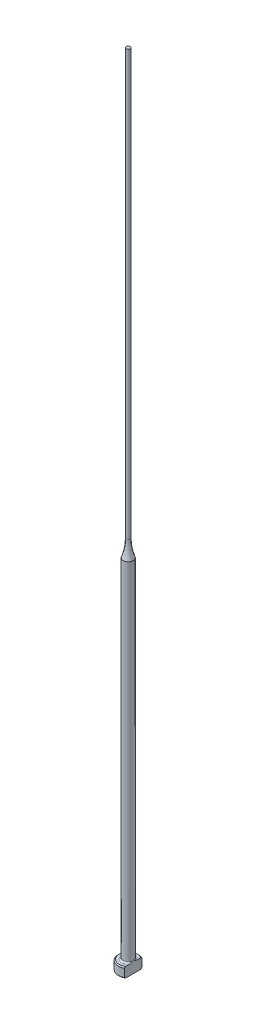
ISO-10303-21;
HEADER;
FILE_DESCRIPTION(('STEP AP214'),'2;1');
FILE_NAME('part.step','',(''),(''),'','','');
FILE_SCHEMA(('AUTOMOTIVE_DESIGN { 1 0 10303 214 1 1 1 1 }'));
ENDSEC;
DATA;
#1=APPLICATION_CONTEXT('core data for automotive mechanical design processes');
#2=APPLICATION_PROTOCOL_DEFINITION('international standard','automotive_design',2000,#1);
#3=PRODUCT_CONTEXT('',#1,'mechanical');
#4=PRODUCT('Part','Part','',(#3));
#5=PRODUCT_RELATED_PRODUCT_CATEGORY('part','',(#4));
#6=PRODUCT_DEFINITION_FORMATION('','',#4);
#7=PRODUCT_DEFINITION_CONTEXT('part definition',#1,'design');
#8=PRODUCT_DEFINITION('design','',#6,#7);
#9=PRODUCT_DEFINITION_SHAPE('','',#8);
#10=(LENGTH_UNIT() NAMED_UNIT(*) SI_UNIT(.MILLI.,.METRE.));
#11=(NAMED_UNIT(*) PLANE_ANGLE_UNIT() SI_UNIT($,.RADIAN.));
#12=(NAMED_UNIT(*) SI_UNIT($,.STERADIAN.) SOLID_ANGLE_UNIT());
#13=UNCERTAINTY_MEASURE_WITH_UNIT(LENGTH_MEASURE(1.E-05),#10,'distance_accuracy_value','');
#14=(GEOMETRIC_REPRESENTATION_CONTEXT(3) GLOBAL_UNCERTAINTY_ASSIGNED_CONTEXT((#13)) GLOBAL_UNIT_ASSIGNED_CONTEXT((#10,
#11,#12)) REPRESENTATION_CONTEXT('',''));
#15=CARTESIAN_POINT('',(0.,0.,0.));
#16=DIRECTION('',(0.,0.,1.));
#17=DIRECTION('',(1.,0.,0.));
#18=AXIS2_PLACEMENT_3D('',#15,#16,#17);
#19=CARTESIAN_POINT('',(-1.99999999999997,2.,0.));
#20=DIRECTION('',(0.,1.,0.));
#21=DIRECTION('',(0.,0.,1.));
#22=AXIS2_PLACEMENT_3D('',#19,#20,#21);
#23=PLANE('',#22);
#24=CARTESIAN_POINT('',(0.,2.,0.));
#25=DIRECTION('',(0.,1.,0.));
#26=DIRECTION('',(0.,0.,1.));
#27=AXIS2_PLACEMENT_3D('',#24,#25,#26);
#28=CIRCLE('',#27,1.79999999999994);
#29=CARTESIAN_POINT('',(0.999999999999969,2.,-1.49666295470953));
#30=VERTEX_POINT('',#29);
#31=CARTESIAN_POINT('',(0.999999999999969,2.,1.49666295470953));
#32=VERTEX_POINT('',#31);
#33=EDGE_CURVE('E187',#30,#32,#28,.T.);
#34=ORIENTED_EDGE('',*,*,#33,.T.);
#35=DIRECTION('',(0.,0.,-1.));
#36=VECTOR('',#35,1.);
#37=CARTESIAN_POINT('',(0.999999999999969,2.,0.));
#38=LINE('',#37,#36);
#39=CARTESIAN_POINT('',(0.999999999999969,2.00000000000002,0.830662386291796));
#40=VERTEX_POINT('',#39);
#41=EDGE_CURVE('E57',#32,#40,#38,.T.);
#42=ORIENTED_EDGE('',*,*,#41,.T.);
#43=CARTESIAN_POINT('',(0.,2.,0.));
#44=DIRECTION('',(0.,1.,0.));
#45=DIRECTION('',(0.,0.,1.));
#46=AXIS2_PLACEMENT_3D('',#43,#44,#45);
#47=CIRCLE('',#46,1.29999999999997);
#48=CARTESIAN_POINT('',(0.999999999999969,2.00000000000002,-0.830662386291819));
#49=VERTEX_POINT('',#48);
#50=EDGE_CURVE('E108',#40,#49,#47,.F.);
#51=ORIENTED_EDGE('',*,*,#50,.T.);
#52=EDGE_CURVE('E137',#49,#30,#38,.T.);
#53=ORIENTED_EDGE('',*,*,#52,.T.);
#54=EDGE_LOOP('',(#34,#42,#51,#53));
#55=FACE_BOUND('',#54,.T.);
#56=ADVANCED_FACE('F32',(#55),#23,.T.);
#57=CARTESIAN_POINT('',(0.,259.958771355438,0.));
#58=DIRECTION('',(0.,1.,0.));
#59=DIRECTION('',(0.,0.,1.));
#60=AXIS2_PLACEMENT_3D('',#57,#58,#59);
#61=CYLINDRICAL_SURFACE('',#60,1.99999999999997);
#62=CARTESIAN_POINT('',(0.,1.79999999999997,0.));
#63=DIRECTION('',(0.,1.,0.));
#64=DIRECTION('',(0.,0.,1.));
#65=AXIS2_PLACEMENT_3D('',#62,#63,#64);
#66=CIRCLE('',#65,1.99999999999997);
#67=CARTESIAN_POINT('',(0.999999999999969,1.79999999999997,1.73205080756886));
#68=VERTEX_POINT('',#67);
#69=CARTESIAN_POINT('',(0.999999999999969,1.79999999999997,-1.73205080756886));
#70=VERTEX_POINT('',#69);
#71=EDGE_CURVE('E105',#68,#70,#66,.F.);
#72=ORIENTED_EDGE('',*,*,#71,.T.);
#73=DIRECTION('',(0.,-1.,0.));
#74=VECTOR('',#73,1.);
#75=CARTESIAN_POINT('',(0.999999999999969,160.,-1.73205080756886));
#76=LINE('',#75,#74);
#77=CARTESIAN_POINT('',(0.999999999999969,0.199999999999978,-1.73205080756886));
#78=VERTEX_POINT('',#77);
#79=EDGE_CURVE('E193',#70,#78,#76,.T.);
#80=ORIENTED_EDGE('',*,*,#79,.T.);
#81=CARTESIAN_POINT('',(0.,0.199999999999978,0.));
#82=DIRECTION('',(0.,-1.,0.));
#83=DIRECTION('',(0.,0.,-1.));
#84=AXIS2_PLACEMENT_3D('',#81,#82,#83);
#85=CIRCLE('',#84,1.99999999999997);
#86=CARTESIAN_POINT('',(0.999999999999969,0.199999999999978,1.73205080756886));
#87=VERTEX_POINT('',#86);
#88=EDGE_CURVE('E100',#78,#87,#85,.F.);
#89=ORIENTED_EDGE('',*,*,#88,.T.);
#90=DIRECTION('',(0.,-1.,0.));
#91=VECTOR('',#90,1.);
#92=CARTESIAN_POINT('',(0.999999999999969,160.,1.73205080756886));
#93=LINE('',#92,#91);
#94=EDGE_CURVE('E93',#68,#87,#93,.T.);
#95=ORIENTED_EDGE('',*,*,#94,.F.);
#96=EDGE_LOOP('',(#72,#80,#89,#95));
#97=FACE_BOUND('',#96,.T.);
#98=ADVANCED_FACE('F158',(#97),#61,.T.);
#99=CARTESIAN_POINT('',(0.,0.,0.));
#100=DIRECTION('',(0.,-1.,0.));
#101=DIRECTION('',(0.,0.,-1.));
#102=AXIS2_PLACEMENT_3D('',#99,#100,#101);
#103=PLANE('',#102);
#104=CARTESIAN_POINT('',(0.,0.,0.));
#105=DIRECTION('',(0.,-1.,0.));
#106=DIRECTION('',(0.,0.,-1.));
#107=AXIS2_PLACEMENT_3D('',#104,#105,#106);
#108=CIRCLE('',#107,1.79999999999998);
#109=CARTESIAN_POINT('',(0.999999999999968,0.,1.49666295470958));
#110=VERTEX_POINT('',#109);
#111=CARTESIAN_POINT('',(0.999999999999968,0.,-1.49666295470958));
#112=VERTEX_POINT('',#111);
#113=EDGE_CURVE('E98',#110,#112,#108,.T.);
#114=ORIENTED_EDGE('',*,*,#113,.T.);
#115=DIRECTION('',(0.,0.,1.));
#116=VECTOR('',#115,1.);
#117=CARTESIAN_POINT('',(0.999999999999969,0.,-1.73205080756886));
#118=LINE('',#117,#116);
#119=EDGE_CURVE('E83',#112,#110,#118,.T.);
#120=ORIENTED_EDGE('',*,*,#119,.T.);
#121=EDGE_LOOP('',(#114,#120));
#122=FACE_BOUND('',#121,.T.);
#123=ADVANCED_FACE('F103',(#122),#103,.T.);
#124=CARTESIAN_POINT('',(0.,2.,0.));
#125=DIRECTION('',(0.,-1.,0.));
#126=DIRECTION('',(0.,0.,-1.));
#127=AXIS2_PLACEMENT_3D('',#124,#125,#126);
#128=CONICAL_SURFACE('',#127,1.79999999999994,0.785398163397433);
#129=ORIENTED_EDGE('',*,*,#71,.F.);
#130=CARTESIAN_POINT('',(0.999999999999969,-0.143084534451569,3.81417299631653));
#131=CARTESIAN_POINT('',(0.999999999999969,-0.0593997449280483,3.72765647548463));
#132=CARTESIAN_POINT('',(0.999999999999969,0.0241940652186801,3.64105173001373));
#133=CARTESIAN_POINT('',(0.999999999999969,0.191148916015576,3.46761616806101));
#134=CARTESIAN_POINT('',(0.999999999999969,0.274509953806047,3.3807853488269));
#135=CARTESIAN_POINT('',(0.999999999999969,0.524249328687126,3.11979400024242));
#136=CARTESIAN_POINT('',(0.999999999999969,0.690198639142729,2.94522254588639));
#137=CARTESIAN_POINT('',(0.999999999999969,1.01697550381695,2.59782670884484));
#138=CARTESIAN_POINT('',(0.999999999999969,1.17783928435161,2.42503661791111));
#139=CARTESIAN_POINT('',(0.999999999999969,1.41669118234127,2.16364984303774));
#140=CARTESIAN_POINT('',(0.999999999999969,1.49589273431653,2.07616357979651));
#141=CARTESIAN_POINT('',(0.999999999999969,1.65313803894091,1.90015721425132));
#142=CARTESIAN_POINT('',(0.999999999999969,1.73118183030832,1.81163714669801));
#143=CARTESIAN_POINT('',(0.999999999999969,1.85567318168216,1.66767927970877));
#144=CARTESIAN_POINT('',(0.999999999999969,1.90265415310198,1.61270332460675));
#145=CARTESIAN_POINT('',(0.999999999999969,1.99577882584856,1.50203557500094));
#146=CARTESIAN_POINT('',(0.999999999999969,2.04192244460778,1.44634371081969));
#147=CARTESIAN_POINT('',(0.999999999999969,2.13356596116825,1.33345480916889));
#148=CARTESIAN_POINT('',(0.999999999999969,2.17905399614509,1.2762481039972));
#149=CARTESIAN_POINT('',(0.999999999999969,2.26844283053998,1.16060976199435));
#150=CARTESIAN_POINT('',(0.999999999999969,2.3123437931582,1.10217825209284));
#151=CARTESIAN_POINT('',(0.999999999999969,2.39853453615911,0.982773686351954));
#152=CARTESIAN_POINT('',(0.999999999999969,2.44078986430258,0.921775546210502));
#153=CARTESIAN_POINT('',(0.999999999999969,2.52187810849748,0.797387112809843));
#154=CARTESIAN_POINT('',(0.999999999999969,2.56070631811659,0.733993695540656));
#155=CARTESIAN_POINT('',(0.999999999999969,2.6324859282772,0.604932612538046));
#156=CARTESIAN_POINT('',(0.999999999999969,2.66550424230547,0.539302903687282));
#157=CARTESIAN_POINT('',(0.999999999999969,2.72301550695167,0.404437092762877));
#158=CARTESIAN_POINT('',(0.999999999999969,2.74753707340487,0.335214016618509));
#159=CARTESIAN_POINT('',(0.999999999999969,2.77407110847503,0.231400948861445));
#160=CARTESIAN_POINT('',(0.999999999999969,2.78110742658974,0.198093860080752));
#161=CARTESIAN_POINT('',(0.999999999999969,2.79200506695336,0.130954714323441));
#162=CARTESIAN_POINT('',(0.999999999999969,2.7958666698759,0.0971227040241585));
#163=CARTESIAN_POINT('',(0.999999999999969,2.80013905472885,0.0293410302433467));
#164=CARTESIAN_POINT('',(0.999999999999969,2.80056046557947,-0.00460794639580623));
#165=CARTESIAN_POINT('',(0.999999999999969,2.79795882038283,-0.0723663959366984));
#166=CARTESIAN_POINT('',(0.999999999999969,2.79493547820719,-0.106175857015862));
#167=CARTESIAN_POINT('',(0.999999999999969,2.78105481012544,-0.206326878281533));
#168=CARTESIAN_POINT('',(0.999999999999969,2.76542146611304,-0.272037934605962));
#169=CARTESIAN_POINT('',(0.999999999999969,2.73477554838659,-0.368312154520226));
#170=CARTESIAN_POINT('',(0.999999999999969,2.72331063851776,-0.40012349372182));
#171=CARTESIAN_POINT('',(0.999999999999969,2.69840546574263,-0.46296441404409));
#172=CARTESIAN_POINT('',(0.999999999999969,2.68496560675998,-0.493994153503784));
#173=CARTESIAN_POINT('',(0.999999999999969,2.64209309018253,-0.586298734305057));
#174=CARTESIAN_POINT('',(0.999999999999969,2.61022871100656,-0.64643570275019));
#175=CARTESIAN_POINT('',(0.999999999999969,2.5422853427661,-0.764304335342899));
#176=CARTESIAN_POINT('',(0.999999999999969,2.50620119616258,-0.822032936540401));
#177=CARTESIAN_POINT('',(0.999999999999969,2.43107084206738,-0.935840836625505));
#178=CARTESIAN_POINT('',(0.999999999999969,2.39201347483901,-0.991912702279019));
#179=CARTESIAN_POINT('',(0.999999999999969,2.31195870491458,-1.10259849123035));
#180=CARTESIAN_POINT('',(0.999999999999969,2.27096226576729,-1.15721311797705));
#181=CARTESIAN_POINT('',(0.999999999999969,2.18701695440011,-1.26606869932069));
#182=CARTESIAN_POINT('',(0.999999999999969,2.14404946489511,-1.32029522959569));
#183=CARTESIAN_POINT('',(0.999999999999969,2.0570505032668,-1.4278898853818));
#184=CARTESIAN_POINT('',(0.999999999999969,2.01301896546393,-1.48125795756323));
#185=CARTESIAN_POINT('',(0.999999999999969,1.87995068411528,-1.64010952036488));
#186=CARTESIAN_POINT('',(0.999999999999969,1.78973357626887,-1.74460261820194));
#187=CARTESIAN_POINT('',(0.999999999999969,1.62290341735,-1.93426834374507));
#188=CARTESIAN_POINT('',(0.999999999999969,1.54658658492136,-2.01970404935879));
#189=CARTESIAN_POINT('',(0.999999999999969,1.39301250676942,-2.18973019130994));
#190=CARTESIAN_POINT('',(0.999999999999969,1.31575523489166,-2.27432060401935));
#191=CARTESIAN_POINT('',(0.999999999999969,1.08283440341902,-2.52732479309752));
#192=CARTESIAN_POINT('',(0.999999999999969,0.926165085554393,-2.69481086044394));
#193=CARTESIAN_POINT('',(0.999999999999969,0.617772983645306,-3.02147252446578));
#194=CARTESIAN_POINT('',(0.999999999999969,0.466111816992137,-3.18070657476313));
#195=CARTESIAN_POINT('',(0.999999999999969,0.238015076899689,-3.41880818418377));
#196=CARTESIAN_POINT('',(0.999999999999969,0.1619245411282,-3.49800657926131));
#197=CARTESIAN_POINT('',(0.999999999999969,0.00955322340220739,-3.65621892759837));
#198=CARTESIAN_POINT('',(0.999999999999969,-0.0667275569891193,-3.73523288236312));
#199=CARTESIAN_POINT('',(0.999999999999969,-0.14308453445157,-3.81417299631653));
#200=B_SPLINE_CURVE_WITH_KNOTS('',3,(#130,#131,#132,#133,#134,#135,#136,#137,#138,#139,#140,
#141,#142,#143,#144,#145,#146,#147,#148,#149,#150,#151,#152,#153,#154,#155,#156,#157,#158,#159,
#160,#161,#162,#163,#164,#165,#166,#167,#168,#169,#170,#171,#172,#173,#174,#175,#176,#177,#178,
#179,#180,#181,#182,#183,#184,#185,#186,#187,#188,#189,#190,#191,#192,#193,#194,#195,#196,#197,
#198,#199),.UNSPECIFIED.,.F.,.F.,(4,2,2,2,2,2,2,2,2,2,2,2,2,2,2,2,2,2,2,2,2,2,2,2,2,2,2,2,2,2,2,
2,2,2,4),(0.,0.36110162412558,0.722207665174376,1.44478731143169,2.15299784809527,
2.5070263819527,2.8610430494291,3.07798416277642,3.29494655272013,3.51418925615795,
3.73340935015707,3.95594813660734,4.17878792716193,4.39886399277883,4.61819150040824,
4.72018864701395,4.82217677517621,4.92384967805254,5.02553102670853,5.22698459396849,
5.32838854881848,5.4297717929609,5.63365200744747,5.837784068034,6.04272417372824,
6.24756349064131,6.45510395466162,6.66265726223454,7.07676259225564,7.42043039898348,
7.76410778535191,8.45210822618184,9.11180822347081,9.44129145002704,9.77077197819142),.UNSPECIFIED.);
#201=EDGE_CURVE('E136',#68,#32,#200,.T.);
#202=ORIENTED_EDGE('',*,*,#201,.T.);
#203=ORIENTED_EDGE('',*,*,#33,.F.);
#204=EDGE_CURVE('E128',#30,#70,#200,.T.);
#205=ORIENTED_EDGE('',*,*,#204,.T.);
#206=EDGE_LOOP('',(#129,#202,#203,#205));
#207=FACE_BOUND('',#206,.T.);
#208=ADVANCED_FACE('F144',(#207),#128,.T.);
#209=CARTESIAN_POINT('',(0.,0.199999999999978,0.));
#210=DIRECTION('',(0.,1.,0.));
#211=DIRECTION('',(0.,0.,1.));
#212=AXIS2_PLACEMENT_3D('',#209,#210,#211);
#213=CONICAL_SURFACE('',#212,1.99999999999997,0.785398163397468);
#214=ORIENTED_EDGE('',*,*,#88,.F.);
#215=CARTESIAN_POINT('',(0.999999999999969,2.14308453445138,-3.81417299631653));
#216=CARTESIAN_POINT('',(0.999999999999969,2.05939974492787,-3.72765647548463));
#217=CARTESIAN_POINT('',(0.999999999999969,1.97580593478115,-3.64105173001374));
#218=CARTESIAN_POINT('',(0.999999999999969,1.80885108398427,-3.46761616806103));
#219=CARTESIAN_POINT('',(0.999999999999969,1.72549004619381,-3.38078534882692));
#220=CARTESIAN_POINT('',(0.999999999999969,1.47575067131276,-3.11979400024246));
#221=CARTESIAN_POINT('',(0.999999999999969,1.30980136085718,-2.94522254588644));
#222=CARTESIAN_POINT('',(0.999999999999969,0.983024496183,-2.5978267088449));
#223=CARTESIAN_POINT('',(0.999999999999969,0.822160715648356,-2.42503661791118));
#224=CARTESIAN_POINT('',(0.999999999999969,0.583308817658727,-2.16364984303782));
#225=CARTESIAN_POINT('',(0.999999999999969,0.50410726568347,-2.0761635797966));
#226=CARTESIAN_POINT('',(0.999999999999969,0.346861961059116,-1.90015721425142));
#227=CARTESIAN_POINT('',(0.999999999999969,0.26881816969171,-1.81163714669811));
#228=CARTESIAN_POINT('',(0.999999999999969,0.144326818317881,-1.66767927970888));
#229=CARTESIAN_POINT('',(0.999999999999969,0.0973458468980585,-1.61270332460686));
#230=CARTESIAN_POINT('',(0.999999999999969,0.00422117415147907,-1.50203557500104));
#231=CARTESIAN_POINT('',(0.999999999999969,-0.0419224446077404,-1.44634371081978));
#232=CARTESIAN_POINT('',(0.999999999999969,-0.133565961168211,-1.33345480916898));
#233=CARTESIAN_POINT('',(0.999999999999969,-0.179053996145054,-1.27624810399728));
#234=CARTESIAN_POINT('',(0.999999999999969,-0.268442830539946,-1.16060976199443));
#235=CARTESIAN_POINT('',(0.999999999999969,-0.31234379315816,-1.10217825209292));
#236=CARTESIAN_POINT('',(0.999999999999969,-0.398534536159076,-0.982773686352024));
#237=CARTESIAN_POINT('',(0.999999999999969,-0.440789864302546,-0.92177554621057));
#238=CARTESIAN_POINT('',(0.999999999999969,-0.521878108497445,-0.797387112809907));
#239=CARTESIAN_POINT('',(0.999999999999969,-0.560706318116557,-0.733993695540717));
#240=CARTESIAN_POINT('',(0.999999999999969,-0.632485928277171,-0.604932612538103));
#241=CARTESIAN_POINT('',(0.999999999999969,-0.665504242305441,-0.539302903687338));
#242=CARTESIAN_POINT('',(0.999999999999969,-0.723015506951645,-0.404437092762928));
#243=CARTESIAN_POINT('',(0.999999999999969,-0.747537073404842,-0.335214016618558));
#244=CARTESIAN_POINT('',(0.999999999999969,-0.774071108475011,-0.231400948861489));
#245=CARTESIAN_POINT('',(0.999999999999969,-0.781107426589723,-0.198093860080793));
#246=CARTESIAN_POINT('',(0.999999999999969,-0.792005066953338,-0.130954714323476));
#247=CARTESIAN_POINT('',(0.999999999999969,-0.795866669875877,-0.0971227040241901));
#248=CARTESIAN_POINT('',(0.999999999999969,-0.800139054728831,-0.0293410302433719));
#249=CARTESIAN_POINT('',(0.999999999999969,-0.80056046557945,0.00460794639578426));
#250=CARTESIAN_POINT('',(0.999999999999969,-0.797958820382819,0.0723663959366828));
#251=CARTESIAN_POINT('',(0.999999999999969,-0.794935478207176,0.106175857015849));
#252=CARTESIAN_POINT('',(0.999999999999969,-0.781054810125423,0.20632687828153));
#253=CARTESIAN_POINT('',(0.999999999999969,-0.765421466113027,0.272037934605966));
#254=CARTESIAN_POINT('',(0.999999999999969,-0.734775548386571,0.36831215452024));
#255=CARTESIAN_POINT('',(0.999999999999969,-0.723310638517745,0.400123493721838));
#256=CARTESIAN_POINT('',(0.999999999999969,-0.698405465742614,0.462964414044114));
#257=CARTESIAN_POINT('',(0.999999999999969,-0.684965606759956,0.493994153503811));
#258=CARTESIAN_POINT('',(0.999999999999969,-0.642093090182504,0.586298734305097));
#259=CARTESIAN_POINT('',(0.999999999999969,-0.610228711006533,0.646435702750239));
#260=CARTESIAN_POINT('',(0.999999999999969,-0.542285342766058,0.764304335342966));
#261=CARTESIAN_POINT('',(0.999999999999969,-0.506201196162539,0.822032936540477));
#262=CARTESIAN_POINT('',(0.999999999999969,-0.431070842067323,0.935840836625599));
#263=CARTESIAN_POINT('',(0.999999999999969,-0.392013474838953,0.991912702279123));
#264=CARTESIAN_POINT('',(0.999999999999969,-0.311958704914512,1.10259849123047));
#265=CARTESIAN_POINT('',(0.999999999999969,-0.270962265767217,1.15721311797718));
#266=CARTESIAN_POINT('',(0.999999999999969,-0.187016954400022,1.26606869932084));
#267=CARTESIAN_POINT('',(0.999999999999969,-0.144049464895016,1.32029522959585));
#268=CARTESIAN_POINT('',(0.999999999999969,-0.0570505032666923,1.42788988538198));
#269=CARTESIAN_POINT('',(0.999999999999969,-0.0130189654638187,1.48125795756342));
#270=CARTESIAN_POINT('',(0.999999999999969,0.120049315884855,1.64010952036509));
#271=CARTESIAN_POINT('',(0.999999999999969,0.21026642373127,1.74460261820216));
#272=CARTESIAN_POINT('',(0.999999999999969,0.37709658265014,1.9342683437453));
#273=CARTESIAN_POINT('',(0.999999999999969,0.453413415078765,2.01970404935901));
#274=CARTESIAN_POINT('',(0.999999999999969,0.606987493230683,2.18973019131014));
#275=CARTESIAN_POINT('',(0.999999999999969,0.684244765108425,2.27432060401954));
#276=CARTESIAN_POINT('',(0.999999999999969,0.917165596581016,2.52732479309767));
#277=CARTESIAN_POINT('',(0.999999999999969,1.07383491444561,2.69481086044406));
#278=CARTESIAN_POINT('',(0.999999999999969,1.38222701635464,3.02147252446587));
#279=CARTESIAN_POINT('',(0.999999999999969,1.53388818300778,3.1807065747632));
#280=CARTESIAN_POINT('',(0.999999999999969,1.76198492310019,3.41880818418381));
#281=CARTESIAN_POINT('',(0.999999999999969,1.83807545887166,3.49800657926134));
#282=CARTESIAN_POINT('',(0.999999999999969,1.99044677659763,3.65621892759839));
#283=CARTESIAN_POINT('',(0.999999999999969,2.06672755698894,3.73523288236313));
#284=CARTESIAN_POINT('',(0.999999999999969,2.14308453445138,3.81417299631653));
#285=B_SPLINE_CURVE_WITH_KNOTS('',3,(#215,#216,#217,#218,#219,#220,#221,#222,#223,#224,#225,
#226,#227,#228,#229,#230,#231,#232,#233,#234,#235,#236,#237,#238,#239,#240,#241,#242,#243,#244,
#245,#246,#247,#248,#249,#250,#251,#252,#253,#254,#255,#256,#257,#258,#259,#260,#261,#262,#263,
#264,#265,#266,#267,#268,#269,#270,#271,#272,#273,#274,#275,#276,#277,#278,#279,#280,#281,#282,
#283,#284),.UNSPECIFIED.,.F.,.F.,(4,2,2,2,2,2,2,2,2,2,2,2,2,2,2,2,2,2,2,2,2,2,2,2,2,2,2,2,2,2,2,
2,2,2,4),(0.,0.36110162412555,0.722207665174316,1.44478731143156,2.15299784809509,
2.5070263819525,2.86104304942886,3.07798416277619,3.2949465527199,3.51418925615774,
3.73340935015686,3.95594813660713,4.17878792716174,4.39886399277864,4.61819150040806,
4.72018864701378,4.82217677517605,4.92384967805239,5.02553102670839,5.22698459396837,
5.32838854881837,5.4297717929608,5.6336520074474,5.83778406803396,6.04272417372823,
6.24756349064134,6.45510395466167,6.66265726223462,7.07676259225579,7.42043039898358,
7.76410778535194,8.45210822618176,9.11180822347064,9.44129145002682,9.77077197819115),.UNSPECIFIED.);
#286=EDGE_CURVE('E86',#78,#112,#285,.T.);
#287=ORIENTED_EDGE('',*,*,#286,.T.);
#288=ORIENTED_EDGE('',*,*,#113,.F.);
#289=EDGE_CURVE('E89',#110,#87,#285,.T.);
#290=ORIENTED_EDGE('',*,*,#289,.T.);
#291=EDGE_LOOP('',(#214,#287,#288,#290));
#292=FACE_BOUND('',#291,.T.);
#293=ADVANCED_FACE('F97',(#292),#213,.T.);
#294=CARTESIAN_POINT('',(0.,2.30000000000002,0.));
#295=DIRECTION('',(0.,1.,0.));
#296=DIRECTION('',(0.,0.,1.));
#297=AXIS2_PLACEMENT_3D('',#294,#295,#296);
#298=TOROIDAL_SURFACE('',#297,1.29999999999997,0.3);
#299=CARTESIAN_POINT('',(0.999999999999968,2.30000000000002,0.));
#300=CARTESIAN_POINT('',(0.999999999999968,2.30000064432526,8.6574445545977E-12));
#301=CARTESIAN_POINT('',(0.999999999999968,2.30000128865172,-9.05742231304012E-08));
#302=CARTESIAN_POINT('',(0.999999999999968,2.30000254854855,-3.98319620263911E-07));
#303=CARTESIAN_POINT('',(0.999999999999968,2.30000316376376,-6.16748313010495E-07));
#304=CARTESIAN_POINT('',(0.999999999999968,2.30000438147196,-1.15047367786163E-06));
#305=CARTESIAN_POINT('',(0.999999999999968,2.30000498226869,-1.46954564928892E-06));
#306=CARTESIAN_POINT('',(0.999999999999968,2.30000613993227,-2.17388585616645E-06));
#307=CARTESIAN_POINT('',(0.999999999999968,2.3000066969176,-2.55896592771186E-06));
#308=CARTESIAN_POINT('',(0.999999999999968,2.30000847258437,-3.89137454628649E-06));
#309=CARTESIAN_POINT('',(0.999999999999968,2.30000962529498,-4.9272569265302E-06));
#310=CARTESIAN_POINT('',(0.999999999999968,2.30001175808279,-7.12255376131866E-06));
#311=CARTESIAN_POINT('',(0.999999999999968,2.30001274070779,-8.27963246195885E-06));
#312=CARTESIAN_POINT('',(0.999999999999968,2.30001619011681,-1.25710396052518E-05));
#313=CARTESIAN_POINT('',(0.999999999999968,2.30001847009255,-1.58589994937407E-05));
#314=CARTESIAN_POINT('',(0.999999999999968,2.3000224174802,-2.25210462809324E-05));
#315=CARTESIAN_POINT('',(0.999999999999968,2.30002411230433,-2.58796667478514E-05));
#316=CARTESIAN_POINT('',(0.999999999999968,2.30003085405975,-3.94941957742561E-05));
#317=CARTESIAN_POINT('',(0.999999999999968,2.30003568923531,-4.98493079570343E-05));
#318=CARTESIAN_POINT('',(0.999999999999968,2.30004388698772,-6.96407730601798E-05));
#319=CARTESIAN_POINT('',(0.999999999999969,2.30004735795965,-7.903098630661E-05));
#320=CARTESIAN_POINT('',(0.999999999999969,2.30007348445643,-0.000144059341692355));
#321=CARTESIAN_POINT('',(0.999999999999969,2.30010510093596,-0.000195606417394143));
#322=CARTESIAN_POINT('',(0.999999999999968,2.30022061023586,-0.000391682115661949));
#323=CARTESIAN_POINT('',(0.999999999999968,2.3002978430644,-0.000539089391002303));
#324=CARTESIAN_POINT('',(0.999999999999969,2.30059433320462,-0.00109591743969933));
#325=CARTESIAN_POINT('',(0.999999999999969,2.30082052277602,-0.00150237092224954));
#326=CARTESIAN_POINT('',(0.999999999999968,2.30171558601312,-0.00311941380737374));
#327=CARTESIAN_POINT('',(0.999999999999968,2.30237677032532,-0.00433326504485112));
#328=CARTESIAN_POINT('',(0.999999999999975,2.31602135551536,-0.0293725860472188));
#329=CARTESIAN_POINT('',(0.99999999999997,2.32909104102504,-0.0531623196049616));
#330=CARTESIAN_POINT('',(0.999999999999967,2.35458080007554,-0.100088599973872));
#331=CARTESIAN_POINT('',(0.999999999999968,2.36700820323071,-0.123221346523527));
#332=CARTESIAN_POINT('',(0.999999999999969,2.39281545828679,-0.172044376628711));
#333=CARTESIAN_POINT('',(0.999999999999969,2.4061616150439,-0.197752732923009));
#334=CARTESIAN_POINT('',(0.999999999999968,2.4323541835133,-0.249714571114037));
#335=CARTESIAN_POINT('',(0.999999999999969,2.44519503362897,-0.27597087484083));
#336=CARTESIAN_POINT('',(0.999999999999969,2.46718175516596,-0.322864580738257));
#337=CARTESIAN_POINT('',(0.999999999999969,2.47650292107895,-0.34341923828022));
#338=CARTESIAN_POINT('',(0.999999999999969,2.49448113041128,-0.384761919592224));
#339=CARTESIAN_POINT('',(0.999999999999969,2.50313958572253,-0.405549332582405));
#340=CARTESIAN_POINT('',(0.999999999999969,2.5276434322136,-0.467585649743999));
#341=CARTESIAN_POINT('',(0.999999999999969,2.54239224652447,-0.509286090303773));
#342=CARTESIAN_POINT('',(0.999999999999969,2.56458900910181,-0.58349816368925));
#343=CARTESIAN_POINT('',(0.999999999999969,2.57294045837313,-0.61573699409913));
#344=CARTESIAN_POINT('',(0.999999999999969,2.58691787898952,-0.682155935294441));
#345=CARTESIAN_POINT('',(0.999999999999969,2.5924232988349,-0.716362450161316));
#346=CARTESIAN_POINT('',(0.999999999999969,2.59932200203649,-0.784996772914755));
#347=CARTESIAN_POINT('',(0.999999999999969,2.60074119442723,-0.819421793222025));
#348=CARTESIAN_POINT('',(0.999999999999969,2.59853032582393,-0.88779225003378));
#349=CARTESIAN_POINT('',(0.999999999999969,2.59495737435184,-0.921738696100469));
#350=CARTESIAN_POINT('',(0.999999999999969,2.58381038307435,-0.977927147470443));
#351=CARTESIAN_POINT('',(0.999999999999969,2.57785171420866,-1.00048693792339));
#352=CARTESIAN_POINT('',(0.999999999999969,2.56267132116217,-1.0445512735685));
#353=CARTESIAN_POINT('',(0.999999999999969,2.55344592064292,-1.06605459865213));
#354=CARTESIAN_POINT('',(0.999999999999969,2.53348156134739,-1.10327564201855));
#355=CARTESIAN_POINT('',(0.999999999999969,2.52335553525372,-1.11931996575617));
#356=CARTESIAN_POINT('',(0.999999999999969,2.50063930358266,-1.1495565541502));
#357=CARTESIAN_POINT('',(0.999999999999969,2.48805327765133,-1.16375189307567));
#358=CARTESIAN_POINT('',(0.999999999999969,2.46313284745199,-1.18709127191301));
#359=CARTESIAN_POINT('',(0.999999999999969,2.45121755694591,-1.19668155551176));
#360=CARTESIAN_POINT('',(0.999999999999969,2.4259612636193,-1.21377371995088));
#361=CARTESIAN_POINT('',(0.999999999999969,2.41262072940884,-1.2212762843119));
#362=CARTESIAN_POINT('',(0.999999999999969,2.38471163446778,-1.23381879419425));
#363=CARTESIAN_POINT('',(0.999999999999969,2.3701356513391,-1.23884240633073));
#364=CARTESIAN_POINT('',(0.999999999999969,2.34029120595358,-1.2460136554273));
#365=CARTESIAN_POINT('',(0.999999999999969,2.32502317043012,-1.24816304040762));
#366=CARTESIAN_POINT('',(0.999999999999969,2.29609418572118,-1.24936303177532));
#367=CARTESIAN_POINT('',(0.999999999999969,2.28244572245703,-1.24873511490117));
#368=CARTESIAN_POINT('',(0.999999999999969,2.25546467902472,-1.24513625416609));
#369=CARTESIAN_POINT('',(0.999999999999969,2.2421320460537,-1.24216570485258));
#370=CARTESIAN_POINT('',(0.999999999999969,2.21644742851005,-1.23414136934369));
#371=CARTESIAN_POINT('',(0.999999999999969,2.20408009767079,-1.22913614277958));
#372=CARTESIAN_POINT('',(0.999999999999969,2.18026539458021,-1.2172891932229));
#373=CARTESIAN_POINT('',(0.999999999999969,2.16881815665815,-1.21044720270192));
#374=CARTESIAN_POINT('',(0.999999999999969,2.14602713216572,-1.19450929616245));
#375=CARTESIAN_POINT('',(0.999999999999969,2.1347876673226,-1.18526487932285));
#376=CARTESIAN_POINT('',(0.999999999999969,2.11372805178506,-1.16528066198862));
#377=CARTESIAN_POINT('',(0.999999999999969,2.1039092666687,-1.15453944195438));
#378=CARTESIAN_POINT('',(0.999999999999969,2.08131380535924,-1.12639326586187));
#379=CARTESIAN_POINT('',(0.999999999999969,2.06941227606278,-1.10828305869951));
#380=CARTESIAN_POINT('',(0.999999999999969,2.04871157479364,-1.07041295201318));
#381=CARTESIAN_POINT('',(0.999999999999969,2.03991325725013,-1.05065259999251));
#382=CARTESIAN_POINT('',(0.999999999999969,2.02219264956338,-1.00203188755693));
#383=CARTESIAN_POINT('',(0.999999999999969,2.01461756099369,-0.972682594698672));
#384=CARTESIAN_POINT('',(0.999999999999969,2.00410660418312,-0.912914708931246));
#385=CARTESIAN_POINT('',(0.999999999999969,2.00122174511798,-0.882487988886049));
#386=CARTESIAN_POINT('',(0.999999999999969,1.99886242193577,-0.80318909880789));
#387=CARTESIAN_POINT('',(0.999999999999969,2.0024814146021,-0.754226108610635));
#388=CARTESIAN_POINT('',(0.999999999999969,2.01327071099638,-0.682724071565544));
#389=CARTESIAN_POINT('',(0.999999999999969,2.01762186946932,-0.659663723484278));
#390=CARTESIAN_POINT('',(0.999999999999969,2.02775671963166,-0.613959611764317));
#391=CARTESIAN_POINT('',(0.999999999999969,2.03353398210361,-0.59131445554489));
#392=CARTESIAN_POINT('',(0.999999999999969,2.05232003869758,-0.525222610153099));
#393=CARTESIAN_POINT('',(0.999999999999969,2.0670175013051,-0.482256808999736));
#394=CARTESIAN_POINT('',(0.999999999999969,2.09166172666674,-0.418361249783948));
#395=CARTESIAN_POINT('',(0.999999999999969,2.10040936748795,-0.396945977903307));
#396=CARTESIAN_POINT('',(0.999999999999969,2.11862724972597,-0.354367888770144));
#397=CARTESIAN_POINT('',(0.999999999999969,2.12809902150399,-0.33320572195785));
#398=CARTESIAN_POINT('',(0.999999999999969,2.15054796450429,-0.284809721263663));
#399=CARTESIAN_POINT('',(0.999999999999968,2.16372144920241,-0.257667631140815));
#400=CARTESIAN_POINT('',(0.999999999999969,2.19063957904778,-0.203972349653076));
#401=CARTESIAN_POINT('',(0.999999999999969,2.20437810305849,-0.177416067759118));
#402=CARTESIAN_POINT('',(0.999999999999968,2.23096755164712,-0.127000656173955));
#403=CARTESIAN_POINT('',(0.999999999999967,2.2437812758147,-0.103121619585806));
#404=CARTESIAN_POINT('',(0.99999999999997,2.27007504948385,-0.0546869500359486));
#405=CARTESIAN_POINT('',(0.999999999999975,2.28356304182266,-0.0301354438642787));
#406=CARTESIAN_POINT('',(0.999999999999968,2.29762327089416,-0.00433318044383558));
#407=CARTESIAN_POINT('',(0.999999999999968,2.29828450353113,-0.00311924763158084));
#408=CARTESIAN_POINT('',(0.999999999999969,2.29917957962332,-0.0015021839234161));
#409=CARTESIAN_POINT('',(0.999999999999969,2.2994057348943,-0.0010957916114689));
#410=CARTESIAN_POINT('',(0.999999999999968,2.29970218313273,-0.000539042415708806));
#411=CARTESIAN_POINT('',(0.999999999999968,2.29977940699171,-0.000391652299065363));
#412=CARTESIAN_POINT('',(0.999999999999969,2.29989490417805,-0.000195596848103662));
#413=CARTESIAN_POINT('',(0.999999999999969,2.2999265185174,-0.000144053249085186));
#414=CARTESIAN_POINT('',(0.999999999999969,2.29995264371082,-7.90290824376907E-05));
#415=CARTESIAN_POINT('',(0.999999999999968,2.29995611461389,-6.96391975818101E-05));
#416=CARTESIAN_POINT('',(0.999999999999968,2.29996431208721,-4.98484228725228E-05));
#417=CARTESIAN_POINT('',(0.999999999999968,2.29996914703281,-3.94936645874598E-05));
#418=CARTESIAN_POINT('',(0.999999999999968,2.29997588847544,-2.587953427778E-05));
#419=CARTESIAN_POINT('',(0.999999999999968,2.29997758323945,-2.25209724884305E-05));
#420=CARTESIAN_POINT('',(0.999999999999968,2.29998153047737,-1.58590310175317E-05));
#421=CARTESIAN_POINT('',(0.999999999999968,2.29998381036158,-1.25711163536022E-05));
#422=CARTESIAN_POINT('',(0.999999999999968,2.29998725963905,-8.27974911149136E-06));
#423=CARTESIAN_POINT('',(0.999999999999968,2.29998824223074,-7.122675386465E-06));
#424=CARTESIAN_POINT('',(0.999999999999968,2.29999037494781,-4.92738159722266E-06));
#425=CARTESIAN_POINT('',(0.999999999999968,2.29999152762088,-3.89149712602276E-06));
#426=CARTESIAN_POINT('',(0.999999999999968,2.29999330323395,-2.5590774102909E-06));
#427=CARTESIAN_POINT('',(0.999999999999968,2.29999386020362,-2.17399250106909E-06));
#428=CARTESIAN_POINT('',(0.999999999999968,2.29999501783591,-1.4696398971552E-06));
#429=CARTESIAN_POINT('',(0.999999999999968,2.299995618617,-1.15056035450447E-06));
#430=CARTESIAN_POINT('',(0.999999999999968,2.29999683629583,-6.16816558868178E-07));
#431=CARTESIAN_POINT('',(0.999999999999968,2.29999745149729,-3.98377208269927E-07));
#432=CARTESIAN_POINT('',(0.999999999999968,2.29999871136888,-9.06063088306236E-08));
#433=CARTESIAN_POINT('',(0.999999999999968,2.29999935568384,-8.657323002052E-12));
#434=CARTESIAN_POINT('',(0.999999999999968,2.30000000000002,0.));
#435=B_SPLINE_CURVE_WITH_KNOTS('',3,(#299,#300,#301,#302,#303,#304,#305,#306,#307,#308,#309,
#310,#311,#312,#313,#314,#315,#316,#317,#318,#319,#320,#321,#322,#323,#324,#325,#326,#327,#328,
#329,#330,#331,#332,#333,#334,#335,#336,#337,#338,#339,#340,#341,#342,#343,#344,#345,#346,#347,
#348,#349,#350,#351,#352,#353,#354,#355,#356,#357,#358,#359,#360,#361,#362,#363,#364,#365,#366,
#367,#368,#369,#370,#371,#372,#373,#374,#375,#376,#377,#378,#379,#380,#381,#382,#383,#384,#385,
#386,#387,#388,#389,#390,#391,#392,#393,#394,#395,#396,#397,#398,#399,#400,#401,#402,#403,#404,
#405,#406,#407,#408,#409,#410,#411,#412,#413,#414,#415,#416,#417,#418,#419,#420,#421,#422,#423,
#424,#425,#426,#427,#428,#429,#430,#431,#432,#433,#434),.UNSPECIFIED.,.T.,.F.,(4,2,2,2,2,2,2,2,
2,2,2,2,2,2,2,2,2,2,2,2,2,2,2,2,2,2,2,2,2,2,2,2,2,2,2,2,2,2,2,2,2,2,2,2,2,2,2,2,2,2,2,2,2,2,2,2,
2,2,2,2,2,2,2,2,2,2,2,4),(0.,1.93088000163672E-06,3.88121487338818E-06,5.91576027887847E-06,
7.94459959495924E-06,1.25713540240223E-05,1.71213138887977E-05,2.9075120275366E-05,
4.0350817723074E-05,7.46190414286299E-05,0.000104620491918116,0.00028499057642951,
0.000785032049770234,0.00217951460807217,0.00632720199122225,0.0877445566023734,
0.166524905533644,0.253417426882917,0.341089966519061,0.408787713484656,0.476336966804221,
0.608850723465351,0.708652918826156,0.812393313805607,0.915474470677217,1.01738599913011,
1.08718721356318,1.15706723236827,1.21377727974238,1.27039179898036,1.31609373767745,
1.36178069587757,1.40776478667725,1.4537208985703,1.49450576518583,1.5352837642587,
1.57514089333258,1.61500383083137,1.65849635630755,1.70203041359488,1.76667915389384,
1.83134568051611,1.92177629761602,2.0131839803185,2.15955153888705,2.22993031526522,
2.29999742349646,2.43600819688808,2.50540041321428,2.57494356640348,2.66544006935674,
2.75513178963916,2.83643278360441,2.92045687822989,2.92460484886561,2.92599912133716,
2.926499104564,2.92667946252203,2.92670946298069,2.92674372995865,2.92675500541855,
2.92676695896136,2.92677150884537,2.92677613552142,2.92677816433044,2.92678019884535,
2.92678214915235,2.92678408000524),.UNSPECIFIED.);
#436=CARTESIAN_POINT('',(0.999999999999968,2.30000000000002,0.));
#437=VERTEX_POINT('',#436);
#438=EDGE_CURVE('E11',#49,#437,#435,.T.);
#439=ORIENTED_EDGE('',*,*,#438,.F.);
#440=ORIENTED_EDGE('',*,*,#50,.F.);
#441=CARTESIAN_POINT('',(0.999999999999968,2.30000000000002,0.));
#442=CARTESIAN_POINT('',(0.999999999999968,2.29999935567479,-8.65741696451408E-12));
#443=CARTESIAN_POINT('',(0.999999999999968,2.29999871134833,9.05742231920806E-08));
#444=CARTESIAN_POINT('',(0.999999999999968,2.2999974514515,3.98319620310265E-07));
#445=CARTESIAN_POINT('',(0.999999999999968,2.29999683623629,6.16748313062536E-07));
#446=CARTESIAN_POINT('',(0.999999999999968,2.29999561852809,1.15047367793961E-06));
#447=CARTESIAN_POINT('',(0.999999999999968,2.29999501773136,1.46954564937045E-06));
#448=CARTESIAN_POINT('',(0.999999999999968,2.29999386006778,2.17388585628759E-06));
#449=CARTESIAN_POINT('',(0.999999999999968,2.29999330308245,2.55896592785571E-06));
#450=CARTESIAN_POINT('',(0.999999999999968,2.29999152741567,3.89137454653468E-06));
#451=CARTESIAN_POINT('',(0.999999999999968,2.29999037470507,4.92725692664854E-06));
#452=CARTESIAN_POINT('',(0.999999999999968,2.29998824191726,7.12255376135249E-06));
#453=CARTESIAN_POINT('',(0.999999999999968,2.29998725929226,8.27963246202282E-06));
#454=CARTESIAN_POINT('',(0.999999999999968,2.29998380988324,1.25710396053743E-05));
#455=CARTESIAN_POINT('',(0.999999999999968,2.2999815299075,1.58589994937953E-05));
#456=CARTESIAN_POINT('',(0.999999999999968,2.29997758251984,2.25210462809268E-05));
#457=CARTESIAN_POINT('',(0.999999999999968,2.29997588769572,2.58796667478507E-05));
#458=CARTESIAN_POINT('',(0.999999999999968,2.29996914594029,3.94941957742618E-05));
#459=CARTESIAN_POINT('',(0.999999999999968,2.29996431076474,4.98493079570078E-05));
#460=CARTESIAN_POINT('',(0.999999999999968,2.29995611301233,6.96407730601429E-05));
#461=CARTESIAN_POINT('',(0.999999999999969,2.2999526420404,7.90309863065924E-05));
#462=CARTESIAN_POINT('',(0.999999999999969,2.29992651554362,0.000144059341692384));
#463=CARTESIAN_POINT('',(0.999999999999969,2.29989489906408,0.000195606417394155));
#464=CARTESIAN_POINT('',(0.999999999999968,2.29977938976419,0.000391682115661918));
#465=CARTESIAN_POINT('',(0.999999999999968,2.29970215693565,0.000539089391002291));
#466=CARTESIAN_POINT('',(0.999999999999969,2.29940566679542,0.00109591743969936));
#467=CARTESIAN_POINT('',(0.999999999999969,2.29917947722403,0.00150237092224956));
#468=CARTESIAN_POINT('',(0.999999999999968,2.29828441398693,0.0031194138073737));
#469=CARTESIAN_POINT('',(0.999999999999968,2.29762322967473,0.0043332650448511));
#470=CARTESIAN_POINT('',(0.999999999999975,2.28397864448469,0.0293725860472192));
#471=CARTESIAN_POINT('',(0.99999999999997,2.27090895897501,0.0531623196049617));
#472=CARTESIAN_POINT('',(0.999999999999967,2.24541919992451,0.100088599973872));
#473=CARTESIAN_POINT('',(0.999999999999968,2.23299179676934,0.123221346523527));
#474=CARTESIAN_POINT('',(0.999999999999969,2.20718454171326,0.172044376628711));
#475=CARTESIAN_POINT('',(0.999999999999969,2.19383838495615,0.197752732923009));
#476=CARTESIAN_POINT('',(0.999999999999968,2.16764581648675,0.249714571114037));
#477=CARTESIAN_POINT('',(0.999999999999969,2.15480496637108,0.27597087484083));
#478=CARTESIAN_POINT('',(0.999999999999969,2.13281824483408,0.322864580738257));
#479=CARTESIAN_POINT('',(0.999999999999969,2.1234970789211,0.34341923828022));
#480=CARTESIAN_POINT('',(0.999999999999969,2.10551886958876,0.384761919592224));
#481=CARTESIAN_POINT('',(0.999999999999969,2.09686041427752,0.405549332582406));
#482=CARTESIAN_POINT('',(0.999999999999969,2.07235656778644,0.467585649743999));
#483=CARTESIAN_POINT('',(0.999999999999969,2.05760775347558,0.509286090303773));
#484=CARTESIAN_POINT('',(0.999999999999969,2.03541099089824,0.58349816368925));
#485=CARTESIAN_POINT('',(0.999999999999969,2.02705954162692,0.61573699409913));
#486=CARTESIAN_POINT('',(0.999999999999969,2.01308212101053,0.682155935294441));
#487=CARTESIAN_POINT('',(0.999999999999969,2.00757670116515,0.716362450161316));
#488=CARTESIAN_POINT('',(0.999999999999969,2.00067799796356,0.784996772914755));
#489=CARTESIAN_POINT('',(0.999999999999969,1.99925880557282,0.819421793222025));
#490=CARTESIAN_POINT('',(0.999999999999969,2.00146967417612,0.88779225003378));
#491=CARTESIAN_POINT('',(0.999999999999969,2.00504262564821,0.921738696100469));
#492=CARTESIAN_POINT('',(0.999999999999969,2.0161896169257,0.977927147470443));
#493=CARTESIAN_POINT('',(0.999999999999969,2.02214828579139,1.00048693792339));
#494=CARTESIAN_POINT('',(0.999999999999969,2.03732867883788,1.0445512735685));
#495=CARTESIAN_POINT('',(0.999999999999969,2.04655407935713,1.06605459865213));
#496=CARTESIAN_POINT('',(0.999999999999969,2.06651843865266,1.10327564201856));
#497=CARTESIAN_POINT('',(0.999999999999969,2.07664446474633,1.11931996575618));
#498=CARTESIAN_POINT('',(0.999999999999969,2.09936069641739,1.14955655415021));
#499=CARTESIAN_POINT('',(0.999999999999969,2.11194672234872,1.16375189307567));
#500=CARTESIAN_POINT('',(0.999999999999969,2.13686715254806,1.18709127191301));
#501=CARTESIAN_POINT('',(0.999999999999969,2.14878244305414,1.19668155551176));
#502=CARTESIAN_POINT('',(0.999999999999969,2.17403873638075,1.21377371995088));
#503=CARTESIAN_POINT('',(0.999999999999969,2.18737927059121,1.2212762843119));
#504=CARTESIAN_POINT('',(0.999999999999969,2.21528836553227,1.23381879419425));
#505=CARTESIAN_POINT('',(0.999999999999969,2.22986434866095,1.23884240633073));
#506=CARTESIAN_POINT('',(0.999999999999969,2.25970879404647,1.2460136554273));
#507=CARTESIAN_POINT('',(0.999999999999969,2.27497682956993,1.24816304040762));
#508=CARTESIAN_POINT('',(0.999999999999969,2.30390581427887,1.24936303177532));
#509=CARTESIAN_POINT('',(0.999999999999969,2.31755427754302,1.24873511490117));
#510=CARTESIAN_POINT('',(0.999999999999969,2.34453532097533,1.24513625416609));
#511=CARTESIAN_POINT('',(0.999999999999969,2.35786795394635,1.24216570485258));
#512=CARTESIAN_POINT('',(0.999999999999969,2.38355257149,1.23414136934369));
#513=CARTESIAN_POINT('',(0.999999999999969,2.39591990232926,1.22913614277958));
#514=CARTESIAN_POINT('',(0.999999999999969,2.41973460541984,1.2172891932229));
#515=CARTESIAN_POINT('',(0.999999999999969,2.4311818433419,1.21044720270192));
#516=CARTESIAN_POINT('',(0.999999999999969,2.45397286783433,1.19450929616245));
#517=CARTESIAN_POINT('',(0.999999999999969,2.46521233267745,1.18526487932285));
#518=CARTESIAN_POINT('',(0.999999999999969,2.48627194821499,1.16528066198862));
#519=CARTESIAN_POINT('',(0.999999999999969,2.49609073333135,1.15453944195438));
#520=CARTESIAN_POINT('',(0.999999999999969,2.51868619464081,1.12639326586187));
#521=CARTESIAN_POINT('',(0.999999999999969,2.53058772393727,1.10828305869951));
#522=CARTESIAN_POINT('',(0.999999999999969,2.55128842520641,1.07041295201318));
#523=CARTESIAN_POINT('',(0.999999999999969,2.56008674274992,1.05065259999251));
#524=CARTESIAN_POINT('',(0.999999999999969,2.57780735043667,1.00203188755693));
#525=CARTESIAN_POINT('',(0.999999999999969,2.58538243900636,0.972682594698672));
#526=CARTESIAN_POINT('',(0.999999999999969,2.59589339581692,0.912914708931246));
#527=CARTESIAN_POINT('',(0.999999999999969,2.59877825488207,0.882487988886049));
#528=CARTESIAN_POINT('',(0.999999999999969,2.60113757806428,0.80318909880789));
#529=CARTESIAN_POINT('',(0.999999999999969,2.59751858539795,0.754226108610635));
#530=CARTESIAN_POINT('',(0.999999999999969,2.58672928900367,0.682724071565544));
#531=CARTESIAN_POINT('',(0.999999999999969,2.58237813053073,0.659663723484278));
#532=CARTESIAN_POINT('',(0.999999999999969,2.57224328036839,0.613959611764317));
#533=CARTESIAN_POINT('',(0.999999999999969,2.56646601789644,0.59131445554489));
#534=CARTESIAN_POINT('',(0.999999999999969,2.54767996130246,0.525222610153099));
#535=CARTESIAN_POINT('',(0.999999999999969,2.53298249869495,0.482256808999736));
#536=CARTESIAN_POINT('',(0.999999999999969,2.50833827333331,0.418361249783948));
#537=CARTESIAN_POINT('',(0.999999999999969,2.49959063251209,0.396945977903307));
#538=CARTESIAN_POINT('',(0.999999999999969,2.48137275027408,0.354367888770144));
#539=CARTESIAN_POINT('',(0.999999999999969,2.47190097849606,0.33320572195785));
#540=CARTESIAN_POINT('',(0.999999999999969,2.44945203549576,0.284809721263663));
#541=CARTESIAN_POINT('',(0.999999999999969,2.43627855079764,0.257667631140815));
#542=CARTESIAN_POINT('',(0.999999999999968,2.40936042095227,0.203972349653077));
#543=CARTESIAN_POINT('',(0.999999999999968,2.39562189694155,0.177416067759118));
#544=CARTESIAN_POINT('',(0.999999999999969,2.36903244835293,0.127000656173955));
#545=CARTESIAN_POINT('',(0.999999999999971,2.35621872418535,0.103121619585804));
#546=CARTESIAN_POINT('',(0.999999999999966,2.32992495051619,0.0546869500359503));
#547=CARTESIAN_POINT('',(0.999999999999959,2.31643695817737,0.0301354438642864));
#548=CARTESIAN_POINT('',(0.999999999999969,2.30237672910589,0.0043331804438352));
#549=CARTESIAN_POINT('',(0.99999999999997,2.30171549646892,0.00311924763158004));
#550=CARTESIAN_POINT('',(0.999999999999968,2.30082042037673,0.00150218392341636));
#551=CARTESIAN_POINT('',(0.999999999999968,2.30059426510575,0.00109579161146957));
#552=CARTESIAN_POINT('',(0.999999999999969,2.30029781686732,0.000539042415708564));
#553=CARTESIAN_POINT('',(0.999999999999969,2.30022059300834,0.000391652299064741));
#554=CARTESIAN_POINT('',(0.999999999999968,2.300105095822,0.000195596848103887));
#555=CARTESIAN_POINT('',(0.999999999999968,2.30007348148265,0.000144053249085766));
#556=CARTESIAN_POINT('',(0.999999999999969,2.30004735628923,7.90290824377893E-05));
#557=CARTESIAN_POINT('',(0.999999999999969,2.30004388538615,6.96391975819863E-05));
#558=CARTESIAN_POINT('',(0.999999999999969,2.30003568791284,4.98484228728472E-05));
#559=CARTESIAN_POINT('',(0.999999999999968,2.30003085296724,3.9493664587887E-05));
#560=CARTESIAN_POINT('',(0.999999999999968,2.30002411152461,2.5879534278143E-05));
#561=CARTESIAN_POINT('',(0.999999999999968,2.3000224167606,2.25209724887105E-05));
#562=CARTESIAN_POINT('',(0.999999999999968,2.30001846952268,1.58590310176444E-05));
#563=CARTESIAN_POINT('',(0.999999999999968,2.30001618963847,1.25711163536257E-05));
#564=CARTESIAN_POINT('',(0.999999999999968,2.300012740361,8.27974911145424E-06));
#565=CARTESIAN_POINT('',(0.999999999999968,2.30001175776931,7.12267538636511E-06));
#566=CARTESIAN_POINT('',(0.999999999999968,2.30000962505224,4.92738159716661E-06));
#567=CARTESIAN_POINT('',(0.999999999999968,2.30000847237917,3.89149712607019E-06));
#568=CARTESIAN_POINT('',(0.999999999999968,2.3000066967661,2.55907741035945E-06));
#569=CARTESIAN_POINT('',(0.999999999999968,2.30000613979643,2.17399250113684E-06));
#570=CARTESIAN_POINT('',(0.999999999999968,2.30000498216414,1.46963989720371E-06));
#571=CARTESIAN_POINT('',(0.999999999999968,2.30000438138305,1.15056035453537E-06));
#572=CARTESIAN_POINT('',(0.999999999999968,2.30000316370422,6.16816558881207E-07));
#573=CARTESIAN_POINT('',(0.999999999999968,2.30000254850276,3.98377208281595E-07));
#574=CARTESIAN_POINT('',(0.999999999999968,2.30000128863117,9.06063088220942E-08));
#575=CARTESIAN_POINT('',(0.999999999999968,2.30000064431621,8.65729541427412E-12));
#576=CARTESIAN_POINT('',(0.999999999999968,2.30000000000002,0.));
#577=B_SPLINE_CURVE_WITH_KNOTS('',3,(#441,#442,#443,#444,#445,#446,#447,#448,#449,#450,#451,
#452,#453,#454,#455,#456,#457,#458,#459,#460,#461,#462,#463,#464,#465,#466,#467,#468,#469,#470,
#471,#472,#473,#474,#475,#476,#477,#478,#479,#480,#481,#482,#483,#484,#485,#486,#487,#488,#489,
#490,#491,#492,#493,#494,#495,#496,#497,#498,#499,#500,#501,#502,#503,#504,#505,#506,#507,#508,
#509,#510,#511,#512,#513,#514,#515,#516,#517,#518,#519,#520,#521,#522,#523,#524,#525,#526,#527,
#528,#529,#530,#531,#532,#533,#534,#535,#536,#537,#538,#539,#540,#541,#542,#543,#544,#545,#546,
#547,#548,#549,#550,#551,#552,#553,#554,#555,#556,#557,#558,#559,#560,#561,#562,#563,#564,#565,
#566,#567,#568,#569,#570,#571,#572,#573,#574,#575,#576),.UNSPECIFIED.,.T.,.F.,(4,2,2,2,2,2,2,2,
2,2,2,2,2,2,2,2,2,2,2,2,2,2,2,2,2,2,2,2,2,2,2,2,2,2,2,2,2,2,2,2,2,2,2,2,2,2,2,2,2,2,2,2,2,2,2,2,
2,2,2,2,2,2,2,2,2,2,2,4),(0.,1.93088000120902E-06,3.88121487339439E-06,5.91576027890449E-06,
7.94459959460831E-06,1.2571354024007E-05,1.71213138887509E-05,2.90751202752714E-05,
4.03508177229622E-05,7.46190414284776E-05,0.000104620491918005,0.000284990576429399,
0.000785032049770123,0.00217951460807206,0.00632720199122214,0.0877445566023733,
0.166524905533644,0.253417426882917,0.341089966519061,0.408787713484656,0.476336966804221,
0.608850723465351,0.708652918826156,0.812393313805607,0.915474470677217,1.01738599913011,
1.08718721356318,1.15706723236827,1.21377727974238,1.27039179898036,1.31609373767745,
1.36178069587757,1.40776478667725,1.4537208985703,1.49450576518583,1.5352837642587,
1.57514089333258,1.61500383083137,1.65849635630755,1.70203041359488,1.76667915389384,
1.83134568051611,1.92177629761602,2.0131839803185,2.15955153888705,2.22993031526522,
2.29999742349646,2.43600819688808,2.50540041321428,2.57494356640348,2.66544006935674,
2.75513178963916,2.83643278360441,2.92045687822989,2.92460484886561,2.92599912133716,
2.926499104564,2.92667946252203,2.92670946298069,2.92674372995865,2.92675500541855,
2.92676695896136,2.92677150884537,2.92677613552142,2.92677816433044,2.92678019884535,
2.92678214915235,2.92678408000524),.UNSPECIFIED.);
#578=EDGE_CURVE('E46',#437,#40,#577,.T.);
#579=ORIENTED_EDGE('',*,*,#578,.F.);
#580=CARTESIAN_POINT('',(0.,2.30000000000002,0.));
#581=DIRECTION('',(0.,1.,0.));
#582=DIRECTION('',(0.,0.,1.));
#583=AXIS2_PLACEMENT_3D('',#580,#581,#582);
#584=CIRCLE('',#583,0.999999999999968);
#585=EDGE_CURVE('E104',#437,#437,#584,.T.);
#586=ORIENTED_EDGE('',*,*,#585,.F.);
#587=EDGE_LOOP('',(#439,#440,#579,#586));
#588=FACE_BOUND('',#587,.T.);
#589=ADVANCED_FACE('F34',(#588),#298,.F.);
#590=CARTESIAN_POINT('',(-0.399999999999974,160.,0.));
#591=DIRECTION('',(0.,1.,0.));
#592=DIRECTION('',(0.,0.,1.));
#593=AXIS2_PLACEMENT_3D('',#590,#591,#592);
#594=PLANE('',#593);
#595=CARTESIAN_POINT('',(0.,160.,0.));
#596=DIRECTION('',(0.,1.,0.));
#597=DIRECTION('',(0.,0.,1.));
#598=AXIS2_PLACEMENT_3D('',#595,#596,#597);
#599=CIRCLE('',#598,0.399999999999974);
#600=CARTESIAN_POINT('',(0.,160.,0.399999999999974));
#601=VERTEX_POINT('',#600);
#602=EDGE_CURVE('E186',#601,#601,#599,.T.);
#603=ORIENTED_EDGE('',*,*,#602,.T.);
#604=EDGE_LOOP('',(#603));
#605=FACE_BOUND('',#604,.T.);
#606=ADVANCED_FACE('F149',(#605),#594,.T.);
#607=CARTESIAN_POINT('',(0.,259.958771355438,0.));
#608=DIRECTION('',(0.,1.,0.));
#609=DIRECTION('',(0.,0.,1.));
#610=AXIS2_PLACEMENT_3D('',#607,#608,#609);
#611=CYLINDRICAL_SURFACE('',#610,0.399999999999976);
#612=CARTESIAN_POINT('',(0.,75.,0.));
#613=DIRECTION('',(0.,1.,0.));
#614=DIRECTION('',(0.,0.,1.));
#615=AXIS2_PLACEMENT_3D('',#612,#613,#614);
#616=CIRCLE('',#615,0.399999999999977);
#617=CARTESIAN_POINT('',(0.,75.,0.399999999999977));
#618=VERTEX_POINT('',#617);
#619=EDGE_CURVE('E183',#618,#618,#616,.T.);
#620=ORIENTED_EDGE('',*,*,#619,.T.);
#621=EDGE_LOOP('',(#620));
#622=FACE_BOUND('',#621,.T.);
#623=ORIENTED_EDGE('',*,*,#602,.F.);
#624=EDGE_LOOP('',(#623));
#625=FACE_BOUND('',#624,.T.);
#626=ADVANCED_FACE('F172',(#622,#625),#611,.T.);
#627=CARTESIAN_POINT('',(0.,75.,0.));
#628=DIRECTION('',(0.,1.,0.));
#629=DIRECTION('',(0.,0.,1.));
#630=AXIS2_PLACEMENT_3D('',#627,#628,#629);
#631=TOROIDAL_SURFACE('',#630,10.4,10.);
#632=CARTESIAN_POINT('',(0.,71.5882555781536,0.));
#633=DIRECTION('',(0.,1.,0.));
#634=DIRECTION('',(0.,0.,1.));
#635=AXIS2_PLACEMENT_3D('',#632,#633,#634);
#636=CIRCLE('',#635,0.999999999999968);
#637=CARTESIAN_POINT('',(0.,71.5882555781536,0.999999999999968));
#638=VERTEX_POINT('',#637);
#639=EDGE_CURVE('E101',#638,#638,#636,.T.);
#640=ORIENTED_EDGE('',*,*,#639,.T.);
#641=EDGE_LOOP('',(#640));
#642=FACE_BOUND('',#641,.T.);
#643=ORIENTED_EDGE('',*,*,#619,.F.);
#644=EDGE_LOOP('',(#643));
#645=FACE_BOUND('',#644,.T.);
#646=ADVANCED_FACE('F169',(#642,#645),#631,.F.);
#647=CARTESIAN_POINT('',(0.,259.958771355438,0.));
#648=DIRECTION('',(0.,1.,0.));
#649=DIRECTION('',(0.,0.,1.));
#650=AXIS2_PLACEMENT_3D('',#647,#648,#649);
#651=CYLINDRICAL_SURFACE('',#650,0.999999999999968);
#652=ORIENTED_EDGE('',*,*,#585,.T.);
#653=EDGE_LOOP('',(#652));
#654=FACE_BOUND('',#653,.T.);
#655=ORIENTED_EDGE('',*,*,#639,.F.);
#656=EDGE_LOOP('',(#655));
#657=FACE_BOUND('',#656,.T.);
#658=ADVANCED_FACE('F122',(#654,#657),#651,.T.);
#659=CARTESIAN_POINT('',(0.999999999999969,160.,-1.73205080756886));
#660=DIRECTION('',(1.,0.,0.));
#661=DIRECTION('',(0.,0.,-1.));
#662=AXIS2_PLACEMENT_3D('',#659,#660,#661);
#663=PLANE('',#662);
#664=ORIENTED_EDGE('',*,*,#79,.F.);
#665=ORIENTED_EDGE('',*,*,#204,.F.);
#666=ORIENTED_EDGE('',*,*,#52,.F.);
#667=ORIENTED_EDGE('',*,*,#438,.T.);
#668=ORIENTED_EDGE('',*,*,#578,.T.);
#669=ORIENTED_EDGE('',*,*,#41,.F.);
#670=ORIENTED_EDGE('',*,*,#201,.F.);
#671=ORIENTED_EDGE('',*,*,#94,.T.);
#672=ORIENTED_EDGE('',*,*,#289,.F.);
#673=ORIENTED_EDGE('',*,*,#119,.F.);
#674=ORIENTED_EDGE('',*,*,#286,.F.);
#675=EDGE_LOOP('',(#664,#665,#666,#667,#668,#669,#670,#671,#672,#673,#674));
#676=FACE_BOUND('',#675,.T.);
#677=ADVANCED_FACE('F85',(#676),#663,.T.);
#678=CLOSED_SHELL('',(#56,#98,#123,#208,#293,#589,#606,#626,#646,#658,#677));
#679=MANIFOLD_SOLID_BREP('B2',#678);
#680=ADVANCED_BREP_SHAPE_REPRESENTATION('',(#18,#679),#14);
#681=SHAPE_DEFINITION_REPRESENTATION(#9,#680);
ENDSEC;
END-ISO-10303-21;
